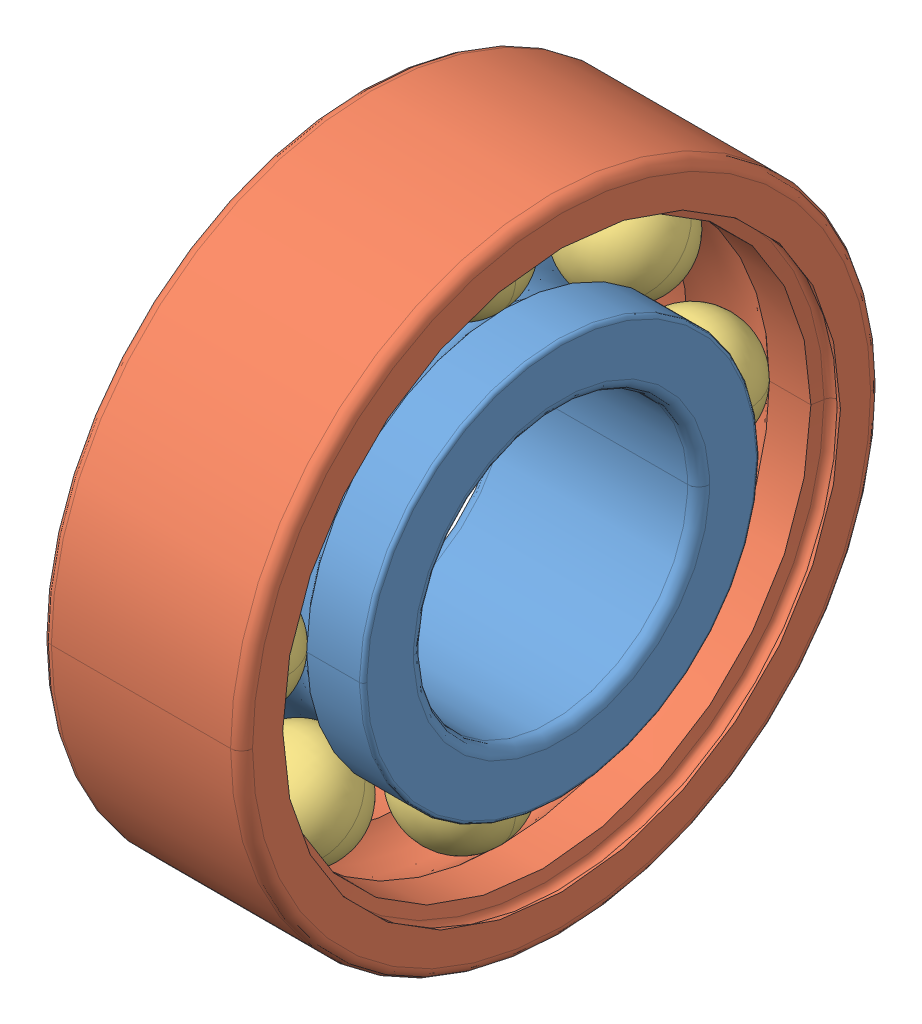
SolidWorks assembly 6202_Z.sldasm, configuration Default (file format 11000). Lengths in mm.
Overall size (11 35 35).
10 component instances, 3 part files, 0 mates.
Components (placement in the parent):
- _6202_Z_PART1_2-1: _6202_Z_PART1_2.sldprt [Default] at origin size (11 30.5 30.5)
- _6202_Z_PART2_4-1: _6202_Z_PART2_4.sldprt [Default] at origin size (11 35 35)
- _6202_Z_PART3_6-1: _6202_Z_PART3_6.sldprt [Default] at origin size (6 6 6)
- _6202_Z_PART3_6-2: _6202_Z_PART3_6.sldprt [Default] x (1 0 0) z (0 0.707107 0.707107) size (6 6 6)
- _6202_Z_PART3_6-3: _6202_Z_PART3_6.sldprt [Default] x (1 0 0) z (0 1 0) size (6 6 6)
- _6202_Z_PART3_6-4: _6202_Z_PART3_6.sldprt [Default] x (1 0 0) z (0 0.707107 -0.707107) size (6 6 6)
- _6202_Z_PART3_6-5: _6202_Z_PART3_6.sldprt [Default] x (1 0 0) z (0 0 -1) size (6 6 6)
- _6202_Z_PART3_6-6: _6202_Z_PART3_6.sldprt [Default] x (1 0 0) z (0 -0.707107 -0.707107) size (6 6 6)
- _6202_Z_PART3_6-7: _6202_Z_PART3_6.sldprt [Default] x (1 0 0) z (0 -1 0) size (6 6 6)
- _6202_Z_PART3_6-8: _6202_Z_PART3_6.sldprt [Default] x (1 0 0) z (0 -0.707107 0.707107) size (6 6 6)
